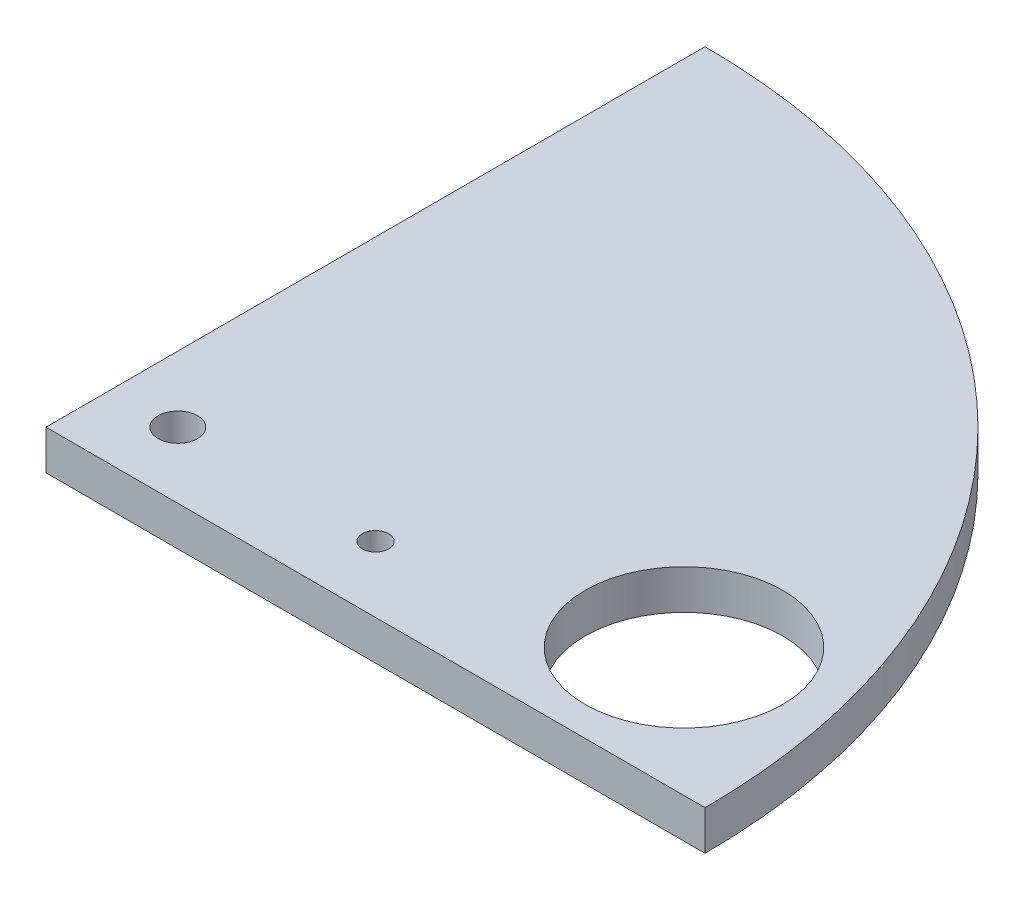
ISO-10303-21;
HEADER;
FILE_DESCRIPTION(('STEP AP214'),'2;1');
FILE_NAME('part.step','',(''),(''),'','','');
FILE_SCHEMA(('AUTOMOTIVE_DESIGN { 1 0 10303 214 1 1 1 1 }'));
ENDSEC;
DATA;
#1=APPLICATION_CONTEXT('core data for automotive mechanical design processes');
#2=APPLICATION_PROTOCOL_DEFINITION('international standard','automotive_design',2000,#1);
#3=PRODUCT_CONTEXT('',#1,'mechanical');
#4=PRODUCT('Part','Part','',(#3));
#5=PRODUCT_RELATED_PRODUCT_CATEGORY('part','',(#4));
#6=PRODUCT_DEFINITION_FORMATION('','',#4);
#7=PRODUCT_DEFINITION_CONTEXT('part definition',#1,'design');
#8=PRODUCT_DEFINITION('design','',#6,#7);
#9=PRODUCT_DEFINITION_SHAPE('','',#8);
#10=(LENGTH_UNIT() NAMED_UNIT(*) SI_UNIT(.MILLI.,.METRE.));
#11=(NAMED_UNIT(*) PLANE_ANGLE_UNIT() SI_UNIT($,.RADIAN.));
#12=(NAMED_UNIT(*) SI_UNIT($,.STERADIAN.) SOLID_ANGLE_UNIT());
#13=UNCERTAINTY_MEASURE_WITH_UNIT(LENGTH_MEASURE(1.E-05),#10,'distance_accuracy_value','');
#14=(GEOMETRIC_REPRESENTATION_CONTEXT(3) GLOBAL_UNCERTAINTY_ASSIGNED_CONTEXT((#13)) GLOBAL_UNIT_ASSIGNED_CONTEXT((#10,
#11,#12)) REPRESENTATION_CONTEXT('',''));
#15=CARTESIAN_POINT('',(0.,0.,0.));
#16=DIRECTION('',(0.,0.,1.));
#17=DIRECTION('',(1.,0.,0.));
#18=AXIS2_PLACEMENT_3D('',#15,#16,#17);
#19=CARTESIAN_POINT('',(0.,3.,0.));
#20=DIRECTION('',(0.,1.,0.));
#21=DIRECTION('',(0.,0.,1.));
#22=AXIS2_PLACEMENT_3D('',#19,#20,#21);
#23=PLANE('',#22);
#24=CARTESIAN_POINT('',(5.,3.,-5.));
#25=DIRECTION('',(0.,1.,0.));
#26=DIRECTION('',(0.,0.,1.));
#27=AXIS2_PLACEMENT_3D('',#24,#25,#26);
#28=CIRCLE('',#27,1.5);
#29=CARTESIAN_POINT('',(5.,3.,-3.5));
#30=VERTEX_POINT('',#29);
#31=EDGE_CURVE('E117',#30,#30,#28,.T.);
#32=ORIENTED_EDGE('',*,*,#31,.F.);
#33=EDGE_LOOP('',(#32));
#34=FACE_BOUND('',#33,.T.);
#35=DIRECTION('',(1.,0.,0.));
#36=VECTOR('',#35,1.);
#37=CARTESIAN_POINT('',(0.,3.,0.));
#38=LINE('',#37,#36);
#39=CARTESIAN_POINT('',(0.,3.,0.));
#40=VERTEX_POINT('',#39);
#41=CARTESIAN_POINT('',(50.,3.,0.));
#42=VERTEX_POINT('',#41);
#43=EDGE_CURVE('E77',#40,#42,#38,.T.);
#44=ORIENTED_EDGE('',*,*,#43,.T.);
#45=CARTESIAN_POINT('',(0.,3.,0.));
#46=DIRECTION('',(0.,1.,0.));
#47=DIRECTION('',(0.,0.,1.));
#48=AXIS2_PLACEMENT_3D('',#45,#46,#47);
#49=CIRCLE('',#48,50.);
#50=CARTESIAN_POINT('',(0.,3.,-50.));
#51=VERTEX_POINT('',#50);
#52=EDGE_CURVE('E73',#42,#51,#49,.T.);
#53=ORIENTED_EDGE('',*,*,#52,.T.);
#54=DIRECTION('',(0.,0.,1.));
#55=VECTOR('',#54,1.);
#56=CARTESIAN_POINT('',(0.,3.,0.));
#57=LINE('',#56,#55);
#58=EDGE_CURVE('E53',#51,#40,#57,.T.);
#59=ORIENTED_EDGE('',*,*,#58,.T.);
#60=EDGE_LOOP('',(#44,#53,#59));
#61=FACE_BOUND('',#60,.T.);
#62=CARTESIAN_POINT('',(38.6691143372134,3.,-9.73188543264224));
#63=DIRECTION('',(0.,1.,0.));
#64=DIRECTION('',(0.,0.,1.));
#65=AXIS2_PLACEMENT_3D('',#62,#63,#64);
#66=CIRCLE('',#65,7.5);
#67=CARTESIAN_POINT('',(38.6691143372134,3.,-2.23188543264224));
#68=VERTEX_POINT('',#67);
#69=EDGE_CURVE('E87',#68,#68,#66,.T.);
#70=ORIENTED_EDGE('',*,*,#69,.F.);
#71=EDGE_LOOP('',(#70));
#72=FACE_BOUND('',#71,.T.);
#73=CARTESIAN_POINT('',(20.,3.,-5.));
#74=DIRECTION('',(0.,1.,0.));
#75=DIRECTION('',(0.,0.,1.));
#76=AXIS2_PLACEMENT_3D('',#73,#74,#75);
#77=CIRCLE('',#76,1.);
#78=CARTESIAN_POINT('',(20.,3.,-4.));
#79=VERTEX_POINT('',#78);
#80=EDGE_CURVE('E112',#79,#79,#77,.T.);
#81=ORIENTED_EDGE('',*,*,#80,.F.);
#82=EDGE_LOOP('',(#81));
#83=FACE_BOUND('',#82,.T.);
#84=ADVANCED_FACE('F36',(#34,#61,#72,#83),#23,.T.);
#85=CARTESIAN_POINT('',(0.,0.,0.));
#86=DIRECTION('',(0.,1.,0.));
#87=DIRECTION('',(0.,0.,1.));
#88=AXIS2_PLACEMENT_3D('',#85,#86,#87);
#89=PLANE('',#88);
#90=DIRECTION('',(1.,0.,0.));
#91=VECTOR('',#90,1.);
#92=CARTESIAN_POINT('',(0.,0.,0.));
#93=LINE('',#92,#91);
#94=CARTESIAN_POINT('',(0.,0.,0.));
#95=VERTEX_POINT('',#94);
#96=CARTESIAN_POINT('',(50.,0.,0.));
#97=VERTEX_POINT('',#96);
#98=EDGE_CURVE('E84',#95,#97,#93,.T.);
#99=ORIENTED_EDGE('',*,*,#98,.F.);
#100=DIRECTION('',(0.,0.,1.));
#101=VECTOR('',#100,1.);
#102=CARTESIAN_POINT('',(0.,0.,0.));
#103=LINE('',#102,#101);
#104=CARTESIAN_POINT('',(0.,0.,-50.));
#105=VERTEX_POINT('',#104);
#106=EDGE_CURVE('E70',#105,#95,#103,.T.);
#107=ORIENTED_EDGE('',*,*,#106,.F.);
#108=CARTESIAN_POINT('',(0.,0.,0.));
#109=DIRECTION('',(0.,1.,0.));
#110=DIRECTION('',(0.,0.,1.));
#111=AXIS2_PLACEMENT_3D('',#108,#109,#110);
#112=CIRCLE('',#111,50.);
#113=EDGE_CURVE('E65',#97,#105,#112,.T.);
#114=ORIENTED_EDGE('',*,*,#113,.F.);
#115=EDGE_LOOP('',(#99,#107,#114));
#116=FACE_BOUND('',#115,.T.);
#117=CARTESIAN_POINT('',(38.6691143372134,0.,-9.73188543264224));
#118=DIRECTION('',(0.,1.,0.));
#119=DIRECTION('',(0.,0.,1.));
#120=AXIS2_PLACEMENT_3D('',#117,#118,#119);
#121=CIRCLE('',#120,7.5);
#122=CARTESIAN_POINT('',(38.6691143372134,0.,-2.23188543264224));
#123=VERTEX_POINT('',#122);
#124=EDGE_CURVE('E91',#123,#123,#121,.T.);
#125=ORIENTED_EDGE('',*,*,#124,.T.);
#126=EDGE_LOOP('',(#125));
#127=FACE_BOUND('',#126,.T.);
#128=CARTESIAN_POINT('',(5.,0.,-5.));
#129=DIRECTION('',(0.,1.,0.));
#130=DIRECTION('',(0.,0.,1.));
#131=AXIS2_PLACEMENT_3D('',#128,#129,#130);
#132=CIRCLE('',#131,1.5);
#133=CARTESIAN_POINT('',(5.,0.,-3.5));
#134=VERTEX_POINT('',#133);
#135=EDGE_CURVE('E107',#134,#134,#132,.T.);
#136=ORIENTED_EDGE('',*,*,#135,.T.);
#137=EDGE_LOOP('',(#136));
#138=FACE_BOUND('',#137,.T.);
#139=CARTESIAN_POINT('',(20.,0.,-5.));
#140=DIRECTION('',(0.,1.,0.));
#141=DIRECTION('',(0.,0.,1.));
#142=AXIS2_PLACEMENT_3D('',#139,#140,#141);
#143=CIRCLE('',#142,1.);
#144=CARTESIAN_POINT('',(20.,0.,-4.));
#145=VERTEX_POINT('',#144);
#146=EDGE_CURVE('E110',#145,#145,#143,.T.);
#147=ORIENTED_EDGE('',*,*,#146,.T.);
#148=EDGE_LOOP('',(#147));
#149=FACE_BOUND('',#148,.T.);
#150=ADVANCED_FACE('F97',(#116,#127,#138,#149),#89,.F.);
#151=CARTESIAN_POINT('',(0.,3.,0.));
#152=DIRECTION('',(0.,0.,-1.));
#153=DIRECTION('',(-1.,0.,0.));
#154=AXIS2_PLACEMENT_3D('',#151,#152,#153);
#155=PLANE('',#154);
#156=ORIENTED_EDGE('',*,*,#98,.T.);
#157=DIRECTION('',(0.,-1.,0.));
#158=VECTOR('',#157,1.);
#159=CARTESIAN_POINT('',(50.,3.,0.));
#160=LINE('',#159,#158);
#161=EDGE_CURVE('E11',#42,#97,#160,.T.);
#162=ORIENTED_EDGE('',*,*,#161,.F.);
#163=ORIENTED_EDGE('',*,*,#43,.F.);
#164=DIRECTION('',(0.,-1.,0.));
#165=VECTOR('',#164,1.);
#166=CARTESIAN_POINT('',(0.,3.,0.));
#167=LINE('',#166,#165);
#168=EDGE_CURVE('E85',#40,#95,#167,.T.);
#169=ORIENTED_EDGE('',*,*,#168,.T.);
#170=EDGE_LOOP('',(#156,#162,#163,#169));
#171=FACE_BOUND('',#170,.T.);
#172=ADVANCED_FACE('F38',(#171),#155,.F.);
#173=CARTESIAN_POINT('',(0.,3.,0.));
#174=DIRECTION('',(0.,-1.,0.));
#175=DIRECTION('',(0.,0.,-1.));
#176=AXIS2_PLACEMENT_3D('',#173,#174,#175);
#177=CYLINDRICAL_SURFACE('',#176,50.);
#178=ORIENTED_EDGE('',*,*,#113,.T.);
#179=DIRECTION('',(0.,-1.,0.));
#180=VECTOR('',#179,1.);
#181=CARTESIAN_POINT('',(0.,3.,-50.));
#182=LINE('',#181,#180);
#183=EDGE_CURVE('E45',#51,#105,#182,.T.);
#184=ORIENTED_EDGE('',*,*,#183,.F.);
#185=ORIENTED_EDGE('',*,*,#52,.F.);
#186=ORIENTED_EDGE('',*,*,#161,.T.);
#187=EDGE_LOOP('',(#178,#184,#185,#186));
#188=FACE_BOUND('',#187,.T.);
#189=ADVANCED_FACE('F74',(#188),#177,.T.);
#190=CARTESIAN_POINT('',(0.,3.,0.));
#191=DIRECTION('',(1.,0.,0.));
#192=DIRECTION('',(0.,0.,-1.));
#193=AXIS2_PLACEMENT_3D('',#190,#191,#192);
#194=PLANE('',#193);
#195=ORIENTED_EDGE('',*,*,#106,.T.);
#196=ORIENTED_EDGE('',*,*,#168,.F.);
#197=ORIENTED_EDGE('',*,*,#58,.F.);
#198=ORIENTED_EDGE('',*,*,#183,.T.);
#199=EDGE_LOOP('',(#195,#196,#197,#198));
#200=FACE_BOUND('',#199,.T.);
#201=ADVANCED_FACE('F96',(#200),#194,.F.);
#202=CARTESIAN_POINT('',(38.6691143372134,3.,-9.73188543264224));
#203=DIRECTION('',(0.,-1.,0.));
#204=DIRECTION('',(0.,0.,-1.));
#205=AXIS2_PLACEMENT_3D('',#202,#203,#204);
#206=CYLINDRICAL_SURFACE('',#205,7.5);
#207=ORIENTED_EDGE('',*,*,#69,.T.);
#208=EDGE_LOOP('',(#207));
#209=FACE_BOUND('',#208,.T.);
#210=ORIENTED_EDGE('',*,*,#124,.F.);
#211=EDGE_LOOP('',(#210));
#212=FACE_BOUND('',#211,.T.);
#213=ADVANCED_FACE('F131',(#209,#212),#206,.F.);
#214=CARTESIAN_POINT('',(5.,3.,-5.));
#215=DIRECTION('',(0.,-1.,0.));
#216=DIRECTION('',(0.,0.,-1.));
#217=AXIS2_PLACEMENT_3D('',#214,#215,#216);
#218=CYLINDRICAL_SURFACE('',#217,1.5);
#219=ORIENTED_EDGE('',*,*,#31,.T.);
#220=EDGE_LOOP('',(#219));
#221=FACE_BOUND('',#220,.T.);
#222=ORIENTED_EDGE('',*,*,#135,.F.);
#223=EDGE_LOOP('',(#222));
#224=FACE_BOUND('',#223,.T.);
#225=ADVANCED_FACE('F123',(#221,#224),#218,.F.);
#226=CARTESIAN_POINT('',(20.,3.,-5.));
#227=DIRECTION('',(0.,-1.,0.));
#228=DIRECTION('',(0.,0.,-1.));
#229=AXIS2_PLACEMENT_3D('',#226,#227,#228);
#230=CYLINDRICAL_SURFACE('',#229,1.);
#231=ORIENTED_EDGE('',*,*,#80,.T.);
#232=EDGE_LOOP('',(#231));
#233=FACE_BOUND('',#232,.T.);
#234=ORIENTED_EDGE('',*,*,#146,.F.);
#235=EDGE_LOOP('',(#234));
#236=FACE_BOUND('',#235,.T.);
#237=ADVANCED_FACE('F180',(#233,#236),#230,.F.);
#238=CLOSED_SHELL('',(#84,#150,#172,#189,#201,#213,#225,#237));
#239=MANIFOLD_SOLID_BREP('B2',#238);
#240=ADVANCED_BREP_SHAPE_REPRESENTATION('',(#18,#239),#14);
#241=SHAPE_DEFINITION_REPRESENTATION(#9,#240);
ENDSEC;
END-ISO-10303-21;
